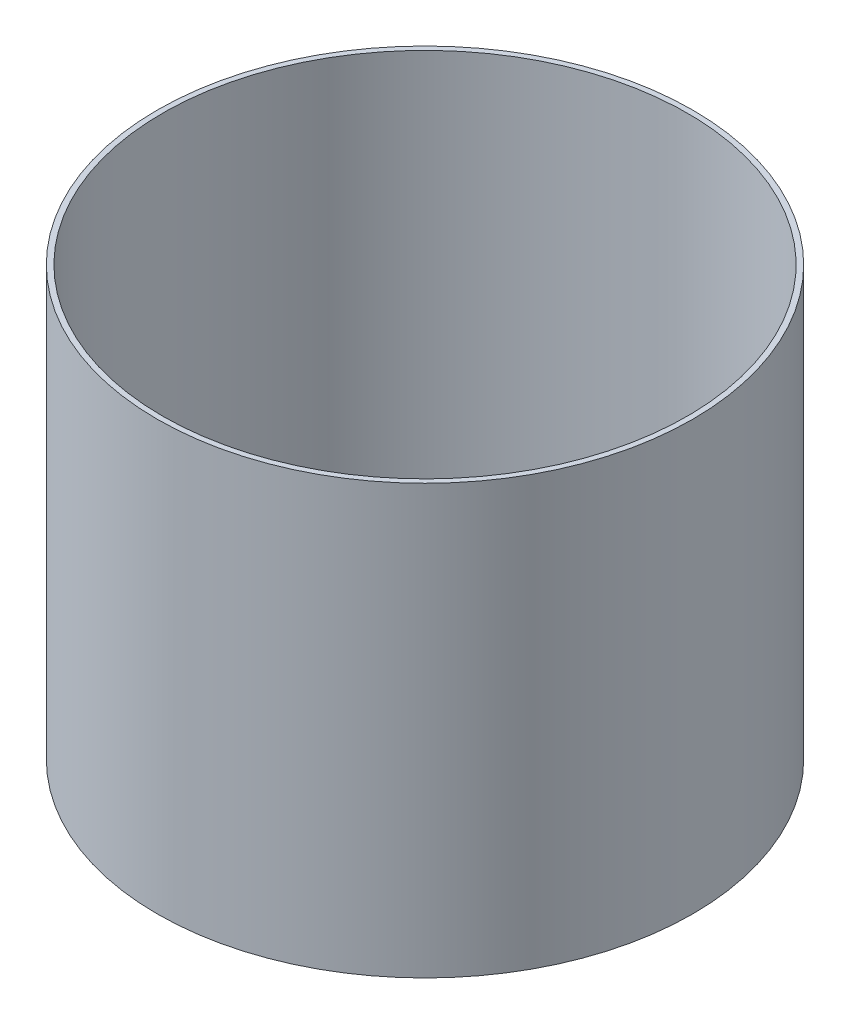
ISO-10303-21;
HEADER;
FILE_DESCRIPTION(('STEP AP214'),'2;1');
FILE_NAME('part.step','',(''),(''),'','','');
FILE_SCHEMA(('AUTOMOTIVE_DESIGN { 1 0 10303 214 1 1 1 1 }'));
ENDSEC;
DATA;
#1=APPLICATION_CONTEXT('core data for automotive mechanical design processes');
#2=APPLICATION_PROTOCOL_DEFINITION('international standard','automotive_design',2000,#1);
#3=PRODUCT_CONTEXT('',#1,'mechanical');
#4=PRODUCT('Part','Part','',(#3));
#5=PRODUCT_RELATED_PRODUCT_CATEGORY('part','',(#4));
#6=PRODUCT_DEFINITION_FORMATION('','',#4);
#7=PRODUCT_DEFINITION_CONTEXT('part definition',#1,'design');
#8=PRODUCT_DEFINITION('design','',#6,#7);
#9=PRODUCT_DEFINITION_SHAPE('','',#8);
#10=(LENGTH_UNIT() NAMED_UNIT(*) SI_UNIT(.MILLI.,.METRE.));
#11=(NAMED_UNIT(*) PLANE_ANGLE_UNIT() SI_UNIT($,.RADIAN.));
#12=(NAMED_UNIT(*) SI_UNIT($,.STERADIAN.) SOLID_ANGLE_UNIT());
#13=UNCERTAINTY_MEASURE_WITH_UNIT(LENGTH_MEASURE(1.E-05),#10,'distance_accuracy_value','');
#14=(GEOMETRIC_REPRESENTATION_CONTEXT(3) GLOBAL_UNCERTAINTY_ASSIGNED_CONTEXT((#13)) GLOBAL_UNIT_ASSIGNED_CONTEXT((#10,
#11,#12)) REPRESENTATION_CONTEXT('',''));
#15=CARTESIAN_POINT('',(0.,0.,0.));
#16=DIRECTION('',(0.,0.,1.));
#17=DIRECTION('',(1.,0.,0.));
#18=AXIS2_PLACEMENT_3D('',#15,#16,#17);
#19=CARTESIAN_POINT('',(0.,-203.2,0.));
#20=DIRECTION('',(0.,1.,0.));
#21=DIRECTION('',(0.,0.,1.));
#22=AXIS2_PLACEMENT_3D('',#19,#20,#21);
#23=CYLINDRICAL_SURFACE('',#22,127.);
#24=CARTESIAN_POINT('',(0.,-203.2,0.));
#25=DIRECTION('',(0.,1.,0.));
#26=DIRECTION('',(0.,0.,1.));
#27=AXIS2_PLACEMENT_3D('',#24,#25,#26);
#28=CIRCLE('',#27,127.);
#29=CARTESIAN_POINT('',(0.,-203.2,127.));
#30=VERTEX_POINT('',#29);
#31=EDGE_CURVE('E11',#30,#30,#28,.T.);
#32=CARTESIAN_POINT('',(0.,0.,0.));
#33=DIRECTION('',(0.,1.,0.));
#34=DIRECTION('',(0.,0.,1.));
#35=AXIS2_PLACEMENT_3D('',#32,#33,#34);
#36=CIRCLE('',#35,127.);
#37=CARTESIAN_POINT('',(0.,0.,127.));
#38=VERTEX_POINT('',#37);
#39=EDGE_CURVE('E38',#38,#38,#36,.T.);
#40=CARTESIAN_POINT('',(0.,-203.2,127.));
#41=CARTESIAN_POINT('',(0.,-201.083333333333,127.));
#42=CARTESIAN_POINT('',(0.,-198.966666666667,127.));
#43=CARTESIAN_POINT('',(0.,-194.733333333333,127.));
#44=CARTESIAN_POINT('',(0.,-192.616666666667,127.));
#45=CARTESIAN_POINT('',(0.,-188.383333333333,127.));
#46=CARTESIAN_POINT('',(0.,-186.266666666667,127.));
#47=CARTESIAN_POINT('',(0.,-182.033333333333,127.));
#48=CARTESIAN_POINT('',(0.,-179.916666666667,127.));
#49=CARTESIAN_POINT('',(0.,-175.683333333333,127.));
#50=CARTESIAN_POINT('',(0.,-173.566666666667,127.));
#51=CARTESIAN_POINT('',(0.,-169.333333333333,127.));
#52=CARTESIAN_POINT('',(0.,-167.216666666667,127.));
#53=CARTESIAN_POINT('',(0.,-162.983333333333,127.));
#54=CARTESIAN_POINT('',(0.,-160.866666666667,127.));
#55=CARTESIAN_POINT('',(0.,-156.633333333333,127.));
#56=CARTESIAN_POINT('',(0.,-154.516666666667,127.));
#57=CARTESIAN_POINT('',(0.,-150.283333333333,127.));
#58=CARTESIAN_POINT('',(0.,-148.166666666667,127.));
#59=CARTESIAN_POINT('',(0.,-143.933333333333,127.));
#60=CARTESIAN_POINT('',(0.,-141.816666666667,127.));
#61=CARTESIAN_POINT('',(0.,-137.583333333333,127.));
#62=CARTESIAN_POINT('',(0.,-135.466666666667,127.));
#63=CARTESIAN_POINT('',(0.,-131.233333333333,127.));
#64=CARTESIAN_POINT('',(0.,-129.116666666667,127.));
#65=CARTESIAN_POINT('',(0.,-124.883333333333,127.));
#66=CARTESIAN_POINT('',(0.,-122.766666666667,127.));
#67=CARTESIAN_POINT('',(0.,-118.533333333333,127.));
#68=CARTESIAN_POINT('',(0.,-116.416666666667,127.));
#69=CARTESIAN_POINT('',(0.,-112.183333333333,127.));
#70=CARTESIAN_POINT('',(0.,-110.066666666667,127.));
#71=CARTESIAN_POINT('',(0.,-105.833333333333,127.));
#72=CARTESIAN_POINT('',(0.,-103.716666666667,127.));
#73=CARTESIAN_POINT('',(0.,-99.4833333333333,127.));
#74=CARTESIAN_POINT('',(0.,-97.3666666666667,127.));
#75=CARTESIAN_POINT('',(0.,-93.1333333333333,127.));
#76=CARTESIAN_POINT('',(0.,-91.0166666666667,127.));
#77=CARTESIAN_POINT('',(0.,-86.7833333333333,127.));
#78=CARTESIAN_POINT('',(0.,-84.6666666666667,127.));
#79=CARTESIAN_POINT('',(0.,-80.4333333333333,127.));
#80=CARTESIAN_POINT('',(0.,-78.3166666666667,127.));
#81=CARTESIAN_POINT('',(0.,-74.0833333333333,127.));
#82=CARTESIAN_POINT('',(0.,-71.9666666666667,127.));
#83=CARTESIAN_POINT('',(0.,-67.7333333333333,127.));
#84=CARTESIAN_POINT('',(0.,-65.6166666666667,127.));
#85=CARTESIAN_POINT('',(0.,-61.3833333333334,127.));
#86=CARTESIAN_POINT('',(0.,-59.2666666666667,127.));
#87=CARTESIAN_POINT('',(0.,-55.0333333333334,127.));
#88=CARTESIAN_POINT('',(0.,-52.9166666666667,127.));
#89=CARTESIAN_POINT('',(0.,-48.6833333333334,127.));
#90=CARTESIAN_POINT('',(0.,-46.5666666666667,127.));
#91=CARTESIAN_POINT('',(0.,-42.3333333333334,127.));
#92=CARTESIAN_POINT('',(0.,-40.2166666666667,127.));
#93=CARTESIAN_POINT('',(0.,-35.9833333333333,127.));
#94=CARTESIAN_POINT('',(0.,-33.8666666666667,127.));
#95=CARTESIAN_POINT('',(0.,-29.6333333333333,127.));
#96=CARTESIAN_POINT('',(0.,-27.5166666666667,127.));
#97=CARTESIAN_POINT('',(0.,-23.2833333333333,127.));
#98=CARTESIAN_POINT('',(0.,-21.1666666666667,127.));
#99=CARTESIAN_POINT('',(0.,-16.9333333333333,127.));
#100=CARTESIAN_POINT('',(0.,-14.8166666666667,127.));
#101=CARTESIAN_POINT('',(0.,-10.5833333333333,127.));
#102=CARTESIAN_POINT('',(0.,-8.46666666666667,127.));
#103=CARTESIAN_POINT('',(0.,-4.23333333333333,127.));
#104=CARTESIAN_POINT('',(0.,-2.11666666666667,127.));
#105=CARTESIAN_POINT('',(0.,0.,127.));
#106=B_SPLINE_CURVE_WITH_KNOTS('',3,(#40,#41,#42,#43,#44,#45,#46,#47,#48,#49,#50,#51,#52,#53,
#54,#55,#56,#57,#58,#59,#60,#61,#62,#63,#64,#65,#66,#67,#68,#69,#70,#71,#72,#73,#74,#75,#76,#77,
#78,#79,#80,#81,#82,#83,#84,#85,#86,#87,#88,#89,#90,#91,#92,#93,#94,#95,#96,#97,#98,#99,#100,
#101,#102,#103,#104,#105),.UNSPECIFIED.,.F.,.F.,(4,2,2,2,2,2,2,2,2,2,2,2,2,2,2,2,2,2,2,2,2,2,2,
2,2,2,2,2,2,2,2,2,4),(0.,6.35000000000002,12.7,19.05,25.4,31.75,38.1,44.45,50.8,57.15,63.5,
69.85,76.2,82.55,88.9,95.25,101.6,107.95,114.3,120.65,127.,133.35,139.7,146.05,152.4,158.75,
165.1,171.45,177.8,184.15,190.5,196.85,203.2),.UNSPECIFIED.);
#107=EDGE_CURVE('BSEAM32',#30,#38,#106,.T.);
#108=ORIENTED_EDGE('',*,*,#31,.T.);
#109=ORIENTED_EDGE('',*,*,#39,.F.);
#110=ORIENTED_EDGE('',*,*,#107,.T.);
#111=ORIENTED_EDGE('',*,*,#107,.F.);
#112=EDGE_LOOP('',(#108,#110,#109,#111));
#113=FACE_BOUND('',#112,.T.);
#114=ADVANCED_FACE('F32',(#113),#23,.T.);
#115=CARTESIAN_POINT('',(0.,-203.2,0.));
#116=DIRECTION('',(0.,1.,0.));
#117=DIRECTION('',(0.,0.,1.));
#118=AXIS2_PLACEMENT_3D('',#115,#116,#117);
#119=PLANE('',#118);
#120=CARTESIAN_POINT('',(0.,-203.2,0.));
#121=DIRECTION('',(0.,1.,0.));
#122=DIRECTION('',(1.,0.,0.));
#123=AXIS2_PLACEMENT_3D('',#120,#121,#122);
#124=CIRCLE('',#123,124.46);
#125=CARTESIAN_POINT('',(0.,-203.2,124.46));
#126=VERTEX_POINT('',#125);
#127=EDGE_CURVE('E42',#126,#126,#124,.T.);
#128=ORIENTED_EDGE('',*,*,#127,.T.);
#129=EDGE_LOOP('',(#128));
#130=FACE_BOUND('',#129,.T.);
#131=ORIENTED_EDGE('',*,*,#31,.F.);
#132=EDGE_LOOP('',(#131));
#133=FACE_BOUND('',#132,.T.);
#134=ADVANCED_FACE('F56',(#130,#133),#119,.F.);
#135=CARTESIAN_POINT('',(0.,0.,0.));
#136=DIRECTION('',(0.,1.,0.));
#137=DIRECTION('',(0.,0.,1.));
#138=AXIS2_PLACEMENT_3D('',#135,#136,#137);
#139=PLANE('',#138);
#140=CARTESIAN_POINT('',(0.,0.,0.));
#141=DIRECTION('',(0.,1.,0.));
#142=DIRECTION('',(1.,0.,0.));
#143=AXIS2_PLACEMENT_3D('',#140,#141,#142);
#144=CIRCLE('',#143,124.46);
#145=CARTESIAN_POINT('',(0.,0.,124.46));
#146=VERTEX_POINT('',#145);
#147=EDGE_CURVE('E46',#146,#146,#144,.T.);
#148=ORIENTED_EDGE('',*,*,#147,.F.);
#149=EDGE_LOOP('',(#148));
#150=FACE_BOUND('',#149,.T.);
#151=ORIENTED_EDGE('',*,*,#39,.T.);
#152=EDGE_LOOP('',(#151));
#153=FACE_BOUND('',#152,.T.);
#154=ADVANCED_FACE('F54',(#150,#153),#139,.T.);
#155=CARTESIAN_POINT('',(0.,-203.2,0.));
#156=DIRECTION('',(0.,1.,0.));
#157=DIRECTION('',(0.,0.,1.));
#158=AXIS2_PLACEMENT_3D('',#155,#156,#157);
#159=CYLINDRICAL_SURFACE('',#158,124.46);
#160=CARTESIAN_POINT('',(0.,-203.2,124.46));
#161=CARTESIAN_POINT('',(0.,-201.083333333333,124.46));
#162=CARTESIAN_POINT('',(0.,-198.966666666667,124.46));
#163=CARTESIAN_POINT('',(0.,-194.733333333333,124.46));
#164=CARTESIAN_POINT('',(0.,-192.616666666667,124.46));
#165=CARTESIAN_POINT('',(0.,-188.383333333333,124.46));
#166=CARTESIAN_POINT('',(0.,-186.266666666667,124.46));
#167=CARTESIAN_POINT('',(0.,-182.033333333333,124.46));
#168=CARTESIAN_POINT('',(0.,-179.916666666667,124.46));
#169=CARTESIAN_POINT('',(0.,-175.683333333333,124.46));
#170=CARTESIAN_POINT('',(0.,-173.566666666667,124.46));
#171=CARTESIAN_POINT('',(0.,-169.333333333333,124.46));
#172=CARTESIAN_POINT('',(0.,-167.216666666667,124.46));
#173=CARTESIAN_POINT('',(0.,-162.983333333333,124.46));
#174=CARTESIAN_POINT('',(0.,-160.866666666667,124.46));
#175=CARTESIAN_POINT('',(0.,-156.633333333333,124.46));
#176=CARTESIAN_POINT('',(0.,-154.516666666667,124.46));
#177=CARTESIAN_POINT('',(0.,-150.283333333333,124.46));
#178=CARTESIAN_POINT('',(0.,-148.166666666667,124.46));
#179=CARTESIAN_POINT('',(0.,-143.933333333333,124.46));
#180=CARTESIAN_POINT('',(0.,-141.816666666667,124.46));
#181=CARTESIAN_POINT('',(0.,-137.583333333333,124.46));
#182=CARTESIAN_POINT('',(0.,-135.466666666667,124.46));
#183=CARTESIAN_POINT('',(0.,-131.233333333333,124.46));
#184=CARTESIAN_POINT('',(0.,-129.116666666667,124.46));
#185=CARTESIAN_POINT('',(0.,-124.883333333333,124.46));
#186=CARTESIAN_POINT('',(0.,-122.766666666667,124.46));
#187=CARTESIAN_POINT('',(0.,-118.533333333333,124.46));
#188=CARTESIAN_POINT('',(0.,-116.416666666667,124.46));
#189=CARTESIAN_POINT('',(0.,-112.183333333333,124.46));
#190=CARTESIAN_POINT('',(0.,-110.066666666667,124.46));
#191=CARTESIAN_POINT('',(0.,-105.833333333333,124.46));
#192=CARTESIAN_POINT('',(0.,-103.716666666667,124.46));
#193=CARTESIAN_POINT('',(0.,-99.4833333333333,124.46));
#194=CARTESIAN_POINT('',(0.,-97.3666666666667,124.46));
#195=CARTESIAN_POINT('',(0.,-93.1333333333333,124.46));
#196=CARTESIAN_POINT('',(0.,-91.0166666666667,124.46));
#197=CARTESIAN_POINT('',(0.,-86.7833333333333,124.46));
#198=CARTESIAN_POINT('',(0.,-84.6666666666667,124.46));
#199=CARTESIAN_POINT('',(0.,-80.4333333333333,124.46));
#200=CARTESIAN_POINT('',(0.,-78.3166666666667,124.46));
#201=CARTESIAN_POINT('',(0.,-74.0833333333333,124.46));
#202=CARTESIAN_POINT('',(0.,-71.9666666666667,124.46));
#203=CARTESIAN_POINT('',(0.,-67.7333333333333,124.46));
#204=CARTESIAN_POINT('',(0.,-65.6166666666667,124.46));
#205=CARTESIAN_POINT('',(0.,-61.3833333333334,124.46));
#206=CARTESIAN_POINT('',(0.,-59.2666666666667,124.46));
#207=CARTESIAN_POINT('',(0.,-55.0333333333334,124.46));
#208=CARTESIAN_POINT('',(0.,-52.9166666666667,124.46));
#209=CARTESIAN_POINT('',(0.,-48.6833333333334,124.46));
#210=CARTESIAN_POINT('',(0.,-46.5666666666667,124.46));
#211=CARTESIAN_POINT('',(0.,-42.3333333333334,124.46));
#212=CARTESIAN_POINT('',(0.,-40.2166666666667,124.46));
#213=CARTESIAN_POINT('',(0.,-35.9833333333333,124.46));
#214=CARTESIAN_POINT('',(0.,-33.8666666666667,124.46));
#215=CARTESIAN_POINT('',(0.,-29.6333333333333,124.46));
#216=CARTESIAN_POINT('',(0.,-27.5166666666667,124.46));
#217=CARTESIAN_POINT('',(0.,-23.2833333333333,124.46));
#218=CARTESIAN_POINT('',(0.,-21.1666666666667,124.46));
#219=CARTESIAN_POINT('',(0.,-16.9333333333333,124.46));
#220=CARTESIAN_POINT('',(0.,-14.8166666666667,124.46));
#221=CARTESIAN_POINT('',(0.,-10.5833333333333,124.46));
#222=CARTESIAN_POINT('',(0.,-8.46666666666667,124.46));
#223=CARTESIAN_POINT('',(0.,-4.23333333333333,124.46));
#224=CARTESIAN_POINT('',(0.,-2.11666666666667,124.46));
#225=CARTESIAN_POINT('',(0.,0.,124.46));
#226=B_SPLINE_CURVE_WITH_KNOTS('',3,(#160,#161,#162,#163,#164,#165,#166,#167,#168,#169,#170,
#171,#172,#173,#174,#175,#176,#177,#178,#179,#180,#181,#182,#183,#184,#185,#186,#187,#188,#189,
#190,#191,#192,#193,#194,#195,#196,#197,#198,#199,#200,#201,#202,#203,#204,#205,#206,#207,#208,
#209,#210,#211,#212,#213,#214,#215,#216,#217,#218,#219,#220,#221,#222,#223,#224,#225),
.UNSPECIFIED.,.F.,.F.,(4,2,2,2,2,2,2,2,2,2,2,2,2,2,2,2,2,2,2,2,2,2,2,2,2,2,2,2,2,2,2,2,4),(0.,
6.35000000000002,12.7,19.05,25.4,31.75,38.1,44.45,50.8,57.15,63.5,69.85,76.2,82.55,88.9,95.25,
101.6,107.95,114.3,120.65,127.,133.35,139.7,146.05,152.4,158.75,165.1,171.45,177.8,184.15,190.5,
196.85,203.2),.UNSPECIFIED.);
#227=EDGE_CURVE('BSEAM52',#126,#146,#226,.T.);
#228=ORIENTED_EDGE('',*,*,#127,.F.);
#229=ORIENTED_EDGE('',*,*,#147,.T.);
#230=ORIENTED_EDGE('',*,*,#227,.T.);
#231=ORIENTED_EDGE('',*,*,#227,.F.);
#232=EDGE_LOOP('',(#228,#230,#229,#231));
#233=FACE_BOUND('',#232,.T.);
#234=ADVANCED_FACE('F52',(#233),#159,.F.);
#235=CLOSED_SHELL('',(#114,#134,#154,#234));
#236=MANIFOLD_SOLID_BREP('B2',#235);
#237=ADVANCED_BREP_SHAPE_REPRESENTATION('',(#18,#236),#14);
#238=SHAPE_DEFINITION_REPRESENTATION(#9,#237);
ENDSEC;
END-ISO-10303-21;
